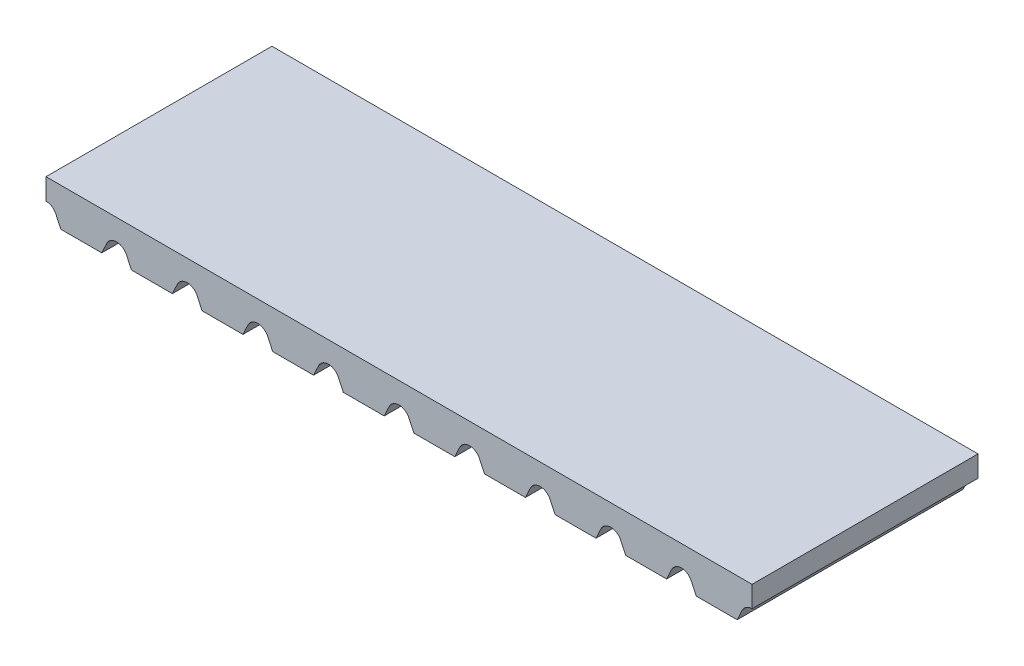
from build123d import *

# Parameters (mm, degrees)
EXTRUDE1_DEPTH  = 8
LPATTERN1_COUNT = 10
LPATTERN1_PITCH = 5


with BuildPart() as part:
    # Sketch1 → Extrude1 (new, symmetric)
    with BuildSketch(Plane.XY):
        with BuildLine():
            Line((-2.5, 0), (2.5, 0))
            Line((2.5, 0), (2.5, -1.5))
            ThreePointArc((2.5, -1.5), (2.085002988, -1.621136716), (1.8, -1.946205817))
            Line((1.8, -1.946205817), (1.4485, -2.7))
            Line((1.4485, -2.7), (-1.4485, -2.7))
            Line((-1.4485, -2.7), (-1.8, -1.946205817))
            ThreePointArc((-1.8, -1.946205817), (-2.085002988, -1.621136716), (-2.5, -1.5))
            Line((-2.5, -1.5), (-2.5, 0))
        make_face()
    extrude1 = extrude(amount=EXTRUDE1_DEPTH, both=True)

    # LPattern1: Extrude1 ×10
    with Locations(*[(i * LPATTERN1_PITCH, 0, 0) for i in range(1, LPATTERN1_COUNT)]):
        add(extrude1)


solid = part.part
